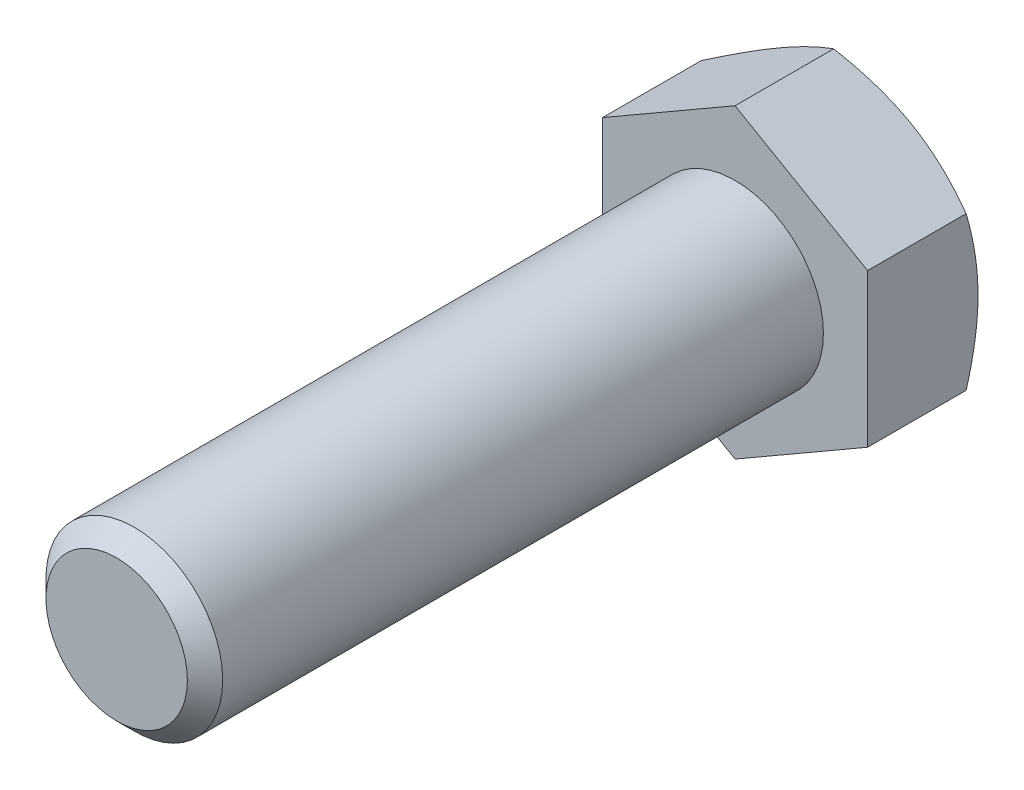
ISO-10303-21;
HEADER;
FILE_DESCRIPTION(('STEP AP214'),'2;1');
FILE_NAME('part.step','',(''),(''),'','','');
FILE_SCHEMA(('AUTOMOTIVE_DESIGN { 1 0 10303 214 1 1 1 1 }'));
ENDSEC;
DATA;
#1=APPLICATION_CONTEXT('core data for automotive mechanical design processes');
#2=APPLICATION_PROTOCOL_DEFINITION('international standard','automotive_design',2000,#1);
#3=PRODUCT_CONTEXT('',#1,'mechanical');
#4=PRODUCT('Part','Part','',(#3));
#5=PRODUCT_RELATED_PRODUCT_CATEGORY('part','',(#4));
#6=PRODUCT_DEFINITION_FORMATION('','',#4);
#7=PRODUCT_DEFINITION_CONTEXT('part definition',#1,'design');
#8=PRODUCT_DEFINITION('design','',#6,#7);
#9=PRODUCT_DEFINITION_SHAPE('','',#8);
#10=(LENGTH_UNIT() NAMED_UNIT(*) SI_UNIT(.MILLI.,.METRE.));
#11=(NAMED_UNIT(*) PLANE_ANGLE_UNIT() SI_UNIT($,.RADIAN.));
#12=(NAMED_UNIT(*) SI_UNIT($,.STERADIAN.) SOLID_ANGLE_UNIT());
#13=UNCERTAINTY_MEASURE_WITH_UNIT(LENGTH_MEASURE(1.E-05),#10,'distance_accuracy_value','');
#14=(GEOMETRIC_REPRESENTATION_CONTEXT(3) GLOBAL_UNCERTAINTY_ASSIGNED_CONTEXT((#13)) GLOBAL_UNIT_ASSIGNED_CONTEXT((#10,
#11,#12)) REPRESENTATION_CONTEXT('',''));
#15=CARTESIAN_POINT('',(0.,0.,0.));
#16=DIRECTION('',(0.,0.,1.));
#17=DIRECTION('',(1.,0.,0.));
#18=AXIS2_PLACEMENT_3D('',#15,#16,#17);
#19=CARTESIAN_POINT('',(0.,0.,70.));
#20=DIRECTION('',(0.,0.,1.));
#21=DIRECTION('',(1.,0.,0.));
#22=AXIS2_PLACEMENT_3D('',#19,#20,#21);
#23=PLANE('',#22);
#24=CARTESIAN_POINT('',(0.,0.,70.));
#25=DIRECTION('',(0.,0.,1.));
#26=DIRECTION('',(1.,0.,0.));
#27=AXIS2_PLACEMENT_3D('',#24,#25,#26);
#28=CIRCLE('',#27,8.);
#29=CARTESIAN_POINT('',(8.00000000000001,0.,70.));
#30=VERTEX_POINT('',#29);
#31=EDGE_CURVE('E203',#30,#30,#28,.T.);
#32=ORIENTED_EDGE('',*,*,#31,.T.);
#33=EDGE_LOOP('',(#32));
#34=FACE_BOUND('',#33,.T.);
#35=ADVANCED_FACE('F29',(#34),#23,.T.);
#36=CARTESIAN_POINT('',(0.,0.,0.));
#37=DIRECTION('',(0.,0.,1.));
#38=DIRECTION('',(1.,0.,0.));
#39=AXIS2_PLACEMENT_3D('',#36,#37,#38);
#40=CYLINDRICAL_SURFACE('',#39,10.);
#41=CARTESIAN_POINT('',(0.,0.,68.));
#42=DIRECTION('',(0.,0.,1.));
#43=DIRECTION('',(1.,0.,0.));
#44=AXIS2_PLACEMENT_3D('',#41,#42,#43);
#45=CIRCLE('',#44,10.);
#46=CARTESIAN_POINT('',(10.,0.,68.));
#47=VERTEX_POINT('',#46);
#48=EDGE_CURVE('E205',#47,#47,#45,.F.);
#49=ORIENTED_EDGE('',*,*,#48,.T.);
#50=EDGE_LOOP('',(#49));
#51=FACE_BOUND('',#50,.T.);
#52=CARTESIAN_POINT('',(0.,0.,0.));
#53=DIRECTION('',(0.,0.,1.));
#54=DIRECTION('',(1.,0.,0.));
#55=AXIS2_PLACEMENT_3D('',#52,#53,#54);
#56=CIRCLE('',#55,10.);
#57=CARTESIAN_POINT('',(10.,0.,0.));
#58=VERTEX_POINT('',#57);
#59=EDGE_CURVE('E206',#58,#58,#56,.F.);
#60=ORIENTED_EDGE('',*,*,#59,.F.);
#61=EDGE_LOOP('',(#60));
#62=FACE_BOUND('',#61,.T.);
#63=ADVANCED_FACE('F194',(#51,#62),#40,.T.);
#64=CARTESIAN_POINT('',(0.,0.,70.));
#65=DIRECTION('',(0.,0.,-1.));
#66=DIRECTION('',(-1.,0.,0.));
#67=AXIS2_PLACEMENT_3D('',#64,#65,#66);
#68=CONICAL_SURFACE('',#67,8.,0.785398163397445);
#69=ORIENTED_EDGE('',*,*,#48,.F.);
#70=EDGE_LOOP('',(#69));
#71=FACE_BOUND('',#70,.T.);
#72=ORIENTED_EDGE('',*,*,#31,.F.);
#73=EDGE_LOOP('',(#72));
#74=FACE_BOUND('',#73,.T.);
#75=ADVANCED_FACE('F199',(#71,#74),#68,.T.);
#76=CARTESIAN_POINT('',(0.,17.3205080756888,-12.5));
#77=DIRECTION('',(0.499999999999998,0.86602540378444,0.));
#78=DIRECTION('',(-0.86602540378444,0.499999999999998,0.));
#79=AXIS2_PLACEMENT_3D('',#76,#77,#78);
#80=PLANE('',#79);
#81=CARTESIAN_POINT('',(-0.000200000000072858,17.3206235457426,-11.160187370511));
#82=CARTESIAN_POINT('',(0.329494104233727,17.130274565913,-11.270078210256));
#83=CARTESIAN_POINT('',(0.660474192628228,16.939183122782,-11.3749824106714));
#84=CARTESIAN_POINT('',(1.32508844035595,16.5554679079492,-11.5734314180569));
#85=CARTESIAN_POINT('',(1.65872343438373,16.3628436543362,-11.6669724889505));
#86=CARTESIAN_POINT('',(2.32929228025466,15.9756905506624,-11.8414378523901));
#87=CARTESIAN_POINT('',(2.66623200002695,15.7811583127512,-11.9223322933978));
#88=CARTESIAN_POINT('',(3.34245276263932,15.3907420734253,-12.0697673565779));
#89=CARTESIAN_POINT('',(3.68173367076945,15.1948581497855,-12.1363087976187));
#90=CARTESIAN_POINT('',(4.35394314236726,14.8067578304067,-12.2522076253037));
#91=CARTESIAN_POINT('',(4.68682180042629,14.6145702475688,-12.3019486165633));
#92=CARTESIAN_POINT('',(5.35410443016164,14.2293144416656,-12.3853532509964));
#93=CARTESIAN_POINT('',(5.68850843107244,14.0362462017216,-12.4190165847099));
#94=CARTESIAN_POINT('',(6.3578781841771,13.6497853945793,-12.4694159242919));
#95=CARTESIAN_POINT('',(6.6928427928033,13.4563934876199,-12.486172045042));
#96=CARTESIAN_POINT('',(7.36308121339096,13.0694311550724,-12.502396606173));
#97=CARTESIAN_POINT('',(7.6983550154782,12.8758607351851,-12.5018655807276));
#98=CARTESIAN_POINT('',(8.32514688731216,12.5139822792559,-12.4847233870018));
#99=CARTESIAN_POINT('',(8.61670962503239,12.3456484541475,-12.470203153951));
#100=CARTESIAN_POINT('',(9.19916443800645,12.0093680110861,-12.4283628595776));
#101=CARTESIAN_POINT('',(9.49005646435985,11.8414214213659,-12.4010418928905));
#102=CARTESIAN_POINT('',(10.0710118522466,11.5060066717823,-12.3340764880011));
#103=CARTESIAN_POINT('',(10.3610743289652,11.338539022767,-12.2944218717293));
#104=CARTESIAN_POINT('',(10.939839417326,11.0043888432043,-12.2034848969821));
#105=CARTESIAN_POINT('',(11.2285419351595,10.8377063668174,-12.1522017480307));
#106=CARTESIAN_POINT('',(12.1049144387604,10.3317324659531,-11.9796131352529));
#107=CARTESIAN_POINT('',(12.6900465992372,9.99390625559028,-11.8410988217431));
#108=CARTESIAN_POINT('',(13.8515859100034,9.32329122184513,-11.5267280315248));
#109=CARTESIAN_POINT('',(14.4280079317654,8.99049381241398,-11.3509453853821));
#110=CARTESIAN_POINT('',(15.0002,8.66013856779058,-11.160187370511));
#111=B_SPLINE_CURVE_WITH_KNOTS('',3,(#81,#82,#83,#84,#85,#86,#87,#88,#89,#90,#91,#92,#93,#94,
#95,#96,#97,#98,#99,#100,#101,#102,#103,#104,#105,#106,#107,#108,#109,#110),.UNSPECIFIED.,.F.,
.F.,(4,2,2,2,2,2,2,2,2,2,2,2,2,2,4),(0.,1.18875411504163,2.37789802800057,3.56980778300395,
4.76164951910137,5.9240737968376,7.08652044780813,8.2475824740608,9.40860862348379,
10.4193068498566,11.4300765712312,12.4416826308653,13.4533574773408,15.5211962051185,
17.5849760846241),.UNSPECIFIED.);
#112=CARTESIAN_POINT('',(0.,17.3205080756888,-11.1602540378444));
#113=VERTEX_POINT('',#112);
#114=CARTESIAN_POINT('',(7.49999999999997,12.9903810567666,-12.5));
#115=VERTEX_POINT('',#114);
#116=EDGE_CURVE('E239',#113,#115,#111,.T.);
#117=ORIENTED_EDGE('',*,*,#116,.F.);
#118=DIRECTION('',(0.,0.,1.));
#119=VECTOR('',#118,1.);
#120=CARTESIAN_POINT('',(0.,17.3205080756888,-12.5));
#121=LINE('',#120,#119);
#122=CARTESIAN_POINT('',(0.,17.3205080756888,0.));
#123=VERTEX_POINT('',#122);
#124=EDGE_CURVE('E213',#113,#123,#121,.T.);
#125=ORIENTED_EDGE('',*,*,#124,.T.);
#126=DIRECTION('',(-0.86602540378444,0.499999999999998,0.));
#127=VECTOR('',#126,1.);
#128=CARTESIAN_POINT('',(0.,17.3205080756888,0.));
#129=LINE('',#128,#127);
#130=CARTESIAN_POINT('',(15.,8.66025403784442,0.));
#131=VERTEX_POINT('',#130);
#132=EDGE_CURVE('E237',#131,#123,#129,.T.);
#133=ORIENTED_EDGE('',*,*,#132,.F.);
#134=DIRECTION('',(0.,0.,1.));
#135=VECTOR('',#134,1.);
#136=CARTESIAN_POINT('',(15.,8.66025403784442,-12.5));
#137=LINE('',#136,#135);
#138=CARTESIAN_POINT('',(15.,8.66025403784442,-11.1602540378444));
#139=VERTEX_POINT('',#138);
#140=EDGE_CURVE('E210',#139,#131,#137,.T.);
#141=ORIENTED_EDGE('',*,*,#140,.F.);
#142=EDGE_CURVE('E169',#115,#139,#111,.T.);
#143=ORIENTED_EDGE('',*,*,#142,.F.);
#144=EDGE_LOOP('',(#117,#125,#133,#141,#143));
#145=FACE_BOUND('',#144,.T.);
#146=ADVANCED_FACE('F179',(#145),#80,.T.);
#147=CARTESIAN_POINT('',(15.,-8.66025403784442,-12.5));
#148=DIRECTION('',(1.,0.,0.));
#149=DIRECTION('',(0.,0.,-1.));
#150=AXIS2_PLACEMENT_3D('',#147,#148,#149);
#151=PLANE('',#150);
#152=CARTESIAN_POINT('',(15.,-23.656342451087,-4.98802951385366));
#153=CARTESIAN_POINT('',(15.,-23.3270368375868,-5.14859323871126));
#154=CARTESIAN_POINT('',(15.,-22.9973552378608,-5.30838548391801));
#155=CARTESIAN_POINT('',(15.,-22.3371617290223,-5.62625300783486));
#156=CARTESIAN_POINT('',(15.,-22.00664981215,-5.7843282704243));
#157=CARTESIAN_POINT('',(15.,-21.0136682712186,-6.25575678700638));
#158=CARTESIAN_POINT('',(15.,-20.3498444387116,-6.56626799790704));
#159=CARTESIAN_POINT('',(15.,-19.0144565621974,-7.1794948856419));
#160=CARTESIAN_POINT('',(15.,-18.3428702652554,-7.48216221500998));
#161=CARTESIAN_POINT('',(15.,-16.9944919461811,-8.07562821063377));
#162=CARTESIAN_POINT('',(15.,-16.3177001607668,-8.36642741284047));
#163=CARTESIAN_POINT('',(15.,-14.9346939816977,-8.9426707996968));
#164=CARTESIAN_POINT('',(15.,-14.2282621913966,-9.22759584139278));
#165=CARTESIAN_POINT('',(15.,-12.8072761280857,-9.77682099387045));
#166=CARTESIAN_POINT('',(15.,-12.0927209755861,-10.0411188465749));
#167=CARTESIAN_POINT('',(15.,-10.6555877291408,-10.5424349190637));
#168=CARTESIAN_POINT('',(15.,-9.93302789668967,-10.7795050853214));
#169=CARTESIAN_POINT('',(15.,-8.47748492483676,-11.2190363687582));
#170=CARTESIAN_POINT('',(15.,-7.74450501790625,-11.4215079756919));
#171=CARTESIAN_POINT('',(15.,-6.63906626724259,-11.691591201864));
#172=CARTESIAN_POINT('',(15.,-6.2706460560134,-11.7758229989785));
#173=CARTESIAN_POINT('',(15.,-5.53121828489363,-11.9321086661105));
#174=CARTESIAN_POINT('',(15.,-5.1602107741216,-12.0041627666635));
#175=CARTESIAN_POINT('',(15.,-4.41583632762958,-12.1348466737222));
#176=CARTESIAN_POINT('',(15.,-4.04246944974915,-12.1934768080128));
#177=CARTESIAN_POINT('',(15.,-3.29373978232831,-12.2961594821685));
#178=CARTESIAN_POINT('',(15.,-2.91837708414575,-12.3402126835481));
#179=CARTESIAN_POINT('',(15.,-2.17125057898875,-12.4122914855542));
#180=CARTESIAN_POINT('',(15.,-1.7995071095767,-12.4405265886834));
#181=CARTESIAN_POINT('',(15.,-1.0551586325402,-12.4812352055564));
#182=CARTESIAN_POINT('',(15.,-0.682553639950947,-12.4937089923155));
#183=CARTESIAN_POINT('',(15.,0.0628536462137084,-12.5025960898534));
#184=CARTESIAN_POINT('',(15.,0.435655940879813,-12.4990093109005));
#185=CARTESIAN_POINT('',(15.,1.18076829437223,-12.4758669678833));
#186=CARTESIAN_POINT('',(15.,1.55307833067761,-12.456310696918));
#187=CARTESIAN_POINT('',(15.,2.43604587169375,-12.3914173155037));
#188=CARTESIAN_POINT('',(15.,2.94620665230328,-12.3391608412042));
#189=CARTESIAN_POINT('',(15.,3.96297341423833,-12.2074265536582));
#190=CARTESIAN_POINT('',(15.,4.46957894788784,-12.1279453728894));
#191=CARTESIAN_POINT('',(15.,5.98333889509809,-11.8528606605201));
#192=CARTESIAN_POINT('',(15.,6.98394325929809,-11.6206572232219));
#193=CARTESIAN_POINT('',(15.,8.48096930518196,-11.2149672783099));
#194=CARTESIAN_POINT('',(15.,8.98506717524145,-11.0681521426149));
#195=CARTESIAN_POINT('',(15.,9.98837333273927,-10.7585239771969));
#196=CARTESIAN_POINT('',(15.,10.4875815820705,-10.5957108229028));
#197=CARTESIAN_POINT('',(15.,11.4812605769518,-10.2567587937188));
#198=CARTESIAN_POINT('',(15.,11.9757325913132,-10.0806236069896));
#199=CARTESIAN_POINT('',(15.,12.7143247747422,-9.80804005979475));
#200=CARTESIAN_POINT('',(15.,12.9600014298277,-9.71578264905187));
#201=CARTESIAN_POINT('',(15.,13.4503781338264,-9.5287050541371));
#202=CARTESIAN_POINT('',(15.,13.6950781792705,-9.43388486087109));
#203=CARTESIAN_POINT('',(15.,14.359390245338,-9.1727978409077));
#204=CARTESIAN_POINT('',(15.,14.7781022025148,-9.0042384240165));
#205=CARTESIAN_POINT('',(15.,15.6130793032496,-8.6611558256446));
#206=CARTESIAN_POINT('',(15.,16.0293443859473,-8.48663249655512));
#207=CARTESIAN_POINT('',(15.,17.2749256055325,-7.95534410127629));
#208=CARTESIAN_POINT('',(15.,18.1009632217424,-7.59088627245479));
#209=CARTESIAN_POINT('',(15.,19.7463472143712,-6.84641952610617));
#210=CARTESIAN_POINT('',(15.,20.5656908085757,-6.46640450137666));
#211=CARTESIAN_POINT('',(15.,22.1987342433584,-5.6945498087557));
#212=CARTESIAN_POINT('',(15.,23.0124343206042,-5.30271064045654));
#213=CARTESIAN_POINT('',(15.,24.6366504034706,-4.50915614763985));
#214=CARTESIAN_POINT('',(15.,25.4471589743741,-4.1074256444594));
#215=CARTESIAN_POINT('',(15.,27.0645048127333,-3.29663533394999));
#216=CARTESIAN_POINT('',(15.,27.8713420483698,-2.88757546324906));
#217=CARTESIAN_POINT('',(15.,29.481823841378,-2.06366878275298));
#218=CARTESIAN_POINT('',(15.,30.2854690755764,-1.64882329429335));
#219=CARTESIAN_POINT('',(15.,31.890265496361,-0.814347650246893));
#220=CARTESIAN_POINT('',(15.,32.691416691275,-0.39471751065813));
#221=CARTESIAN_POINT('',(15.,34.9203498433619,0.77972707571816));
#222=CARTESIAN_POINT('',(15.,36.3458714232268,1.53883048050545));
#223=CARTESIAN_POINT('',(15.,39.1921522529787,3.06610948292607));
#224=CARTESIAN_POINT('',(15.,40.6129111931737,3.83428565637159));
#225=CARTESIAN_POINT('',(15.,43.445900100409,5.37475686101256));
#226=CARTESIAN_POINT('',(15.,44.8581426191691,6.14702882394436));
#227=CARTESIAN_POINT('',(15.,46.9743278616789,7.30926449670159));
#228=CARTESIAN_POINT('',(15.,47.6793316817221,7.6972987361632));
#229=CARTESIAN_POINT('',(15.,49.08870787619,8.47451029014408));
#230=CARTESIAN_POINT('',(15.,49.7930802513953,8.8636876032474));
#231=CARTESIAN_POINT('',(15.,50.4971756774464,9.2533654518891));
#232=B_SPLINE_CURVE_WITH_KNOTS('',3,(#152,#153,#154,#155,#156,#157,#158,#159,#160,#161,#162,
#163,#164,#165,#166,#167,#168,#169,#170,#171,#172,#173,#174,#175,#176,#177,#178,#179,#180,#181,
#182,#183,#184,#185,#186,#187,#188,#189,#190,#191,#192,#193,#194,#195,#196,#197,#198,#199,#200,
#201,#202,#203,#204,#205,#206,#207,#208,#209,#210,#211,#212,#213,#214,#215,#216,#217,#218,#219,
#220,#221,#222,#223,#224,#225,#226,#227,#228,#229,#230,#231),.UNSPECIFIED.,.F.,.F.,(4,2,2,2,2,2,
2,2,2,2,2,2,2,2,2,2,2,2,2,2,2,2,2,2,2,2,2,2,2,2,2,2,2,2,2,2,2,2,2,4),(0.,1.09909142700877,
2.19819316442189,4.39670244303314,6.60652703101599,8.81625171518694,11.1011868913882,
13.3863718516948,15.667121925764,17.9471792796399,19.0807901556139,20.2143795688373,
21.3479412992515,22.4814515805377,23.5995709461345,24.7176709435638,25.8357771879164,
26.9539329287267,28.4915630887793,30.0293835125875,33.1065029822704,34.6814865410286,
36.2564823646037,37.8310437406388,38.618315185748,39.4055894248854,40.7596309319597,
42.1137059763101,44.8220642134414,47.5314960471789,50.2408135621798,52.9545856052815,
55.668381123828,58.3815666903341,61.0947431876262,65.939807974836,70.7851819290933,
75.6139863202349,78.0281952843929,80.4424012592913),.UNSPECIFIED.);
#233=CARTESIAN_POINT('',(15.,0.,-12.5));
#234=VERTEX_POINT('',#233);
#235=EDGE_CURVE('E167',#139,#234,#232,.F.);
#236=ORIENTED_EDGE('',*,*,#235,.F.);
#237=ORIENTED_EDGE('',*,*,#140,.T.);
#238=DIRECTION('',(0.,1.,0.));
#239=VECTOR('',#238,1.);
#240=CARTESIAN_POINT('',(15.,-8.66025403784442,0.));
#241=LINE('',#240,#239);
#242=CARTESIAN_POINT('',(15.,-8.66025403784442,0.));
#243=VERTEX_POINT('',#242);
#244=EDGE_CURVE('E215',#243,#131,#241,.T.);
#245=ORIENTED_EDGE('',*,*,#244,.F.);
#246=DIRECTION('',(0.,0.,1.));
#247=VECTOR('',#246,1.);
#248=CARTESIAN_POINT('',(15.,-8.66025403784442,-12.5));
#249=LINE('',#248,#247);
#250=CARTESIAN_POINT('',(15.,-8.66025403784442,-11.1602540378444));
#251=VERTEX_POINT('',#250);
#252=EDGE_CURVE('E221',#251,#243,#249,.T.);
#253=ORIENTED_EDGE('',*,*,#252,.F.);
#254=EDGE_CURVE('E162',#234,#251,#232,.F.);
#255=ORIENTED_EDGE('',*,*,#254,.F.);
#256=EDGE_LOOP('',(#236,#237,#245,#253,#255));
#257=FACE_BOUND('',#256,.T.);
#258=ADVANCED_FACE('F175',(#257),#151,.T.);
#259=CARTESIAN_POINT('',(0.,-17.3205080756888,-12.5));
#260=DIRECTION('',(0.499999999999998,-0.86602540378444,0.));
#261=DIRECTION('',(0.86602540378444,0.499999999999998,0.));
#262=AXIS2_PLACEMENT_3D('',#259,#260,#261);
#263=PLANE('',#262);
#264=CARTESIAN_POINT('',(15.0002,-8.66013856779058,-11.160187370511));
#265=CARTESIAN_POINT('',(14.6705058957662,-8.85048754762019,-11.2700782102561));
#266=CARTESIAN_POINT('',(14.3395258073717,-9.04157899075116,-11.3749824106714));
#267=CARTESIAN_POINT('',(13.674911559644,-9.42529420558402,-11.5734314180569));
#268=CARTESIAN_POINT('',(13.3412765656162,-9.61791845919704,-11.6669724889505));
#269=CARTESIAN_POINT('',(12.6707077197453,-10.0050715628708,-11.8414378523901));
#270=CARTESIAN_POINT('',(12.333767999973,-10.199603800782,-11.9223322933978));
#271=CARTESIAN_POINT('',(11.6575472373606,-10.5900200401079,-12.069767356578));
#272=CARTESIAN_POINT('',(11.3182663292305,-10.7859039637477,-12.1363087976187));
#273=CARTESIAN_POINT('',(10.6460568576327,-11.1740042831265,-12.2522076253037));
#274=CARTESIAN_POINT('',(10.3131781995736,-11.3661918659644,-12.3019486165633));
#275=CARTESIAN_POINT('',(9.64589556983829,-11.7514476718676,-12.3853532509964));
#276=CARTESIAN_POINT('',(9.31149156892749,-11.9445159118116,-12.4190165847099));
#277=CARTESIAN_POINT('',(8.64212181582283,-12.3309767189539,-12.4694159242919));
#278=CARTESIAN_POINT('',(8.30715720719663,-12.5243686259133,-12.486172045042));
#279=CARTESIAN_POINT('',(7.63691878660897,-12.9113309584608,-12.502396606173));
#280=CARTESIAN_POINT('',(7.30164498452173,-13.1049013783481,-12.5018655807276));
#281=CARTESIAN_POINT('',(6.67485311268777,-13.4667798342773,-12.4847233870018));
#282=CARTESIAN_POINT('',(6.38329037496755,-13.6351136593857,-12.470203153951));
#283=CARTESIAN_POINT('',(5.80083556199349,-13.9713941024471,-12.4283628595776));
#284=CARTESIAN_POINT('',(5.50994353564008,-14.1393406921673,-12.4010418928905));
#285=CARTESIAN_POINT('',(4.92898814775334,-14.4747554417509,-12.3340764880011));
#286=CARTESIAN_POINT('',(4.63892567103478,-14.6422230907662,-12.2944218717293));
#287=CARTESIAN_POINT('',(4.06016058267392,-14.9763732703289,-12.2034848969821));
#288=CARTESIAN_POINT('',(3.77145806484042,-15.1430557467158,-12.1522017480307));
#289=CARTESIAN_POINT('',(2.89508556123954,-15.6490296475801,-11.9796131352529));
#290=CARTESIAN_POINT('',(2.30995340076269,-15.9868558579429,-11.8410988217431));
#291=CARTESIAN_POINT('',(1.14841408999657,-16.6574708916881,-11.5267280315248));
#292=CARTESIAN_POINT('',(0.571992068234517,-16.9902683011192,-11.3509453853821));
#293=CARTESIAN_POINT('',(-0.000200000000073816,-17.3206235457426,-11.160187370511));
#294=B_SPLINE_CURVE_WITH_KNOTS('',3,(#264,#265,#266,#267,#268,#269,#270,#271,#272,#273,#274,
#275,#276,#277,#278,#279,#280,#281,#282,#283,#284,#285,#286,#287,#288,#289,#290,#291,#292,#293),
.UNSPECIFIED.,.F.,.F.,(4,2,2,2,2,2,2,2,2,2,2,2,2,2,4),(0.,1.18875411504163,2.37789802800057,
3.56980778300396,4.76164951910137,5.9240737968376,7.08652044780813,8.2475824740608,
9.40860862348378,10.4193068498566,11.4300765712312,12.4416826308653,13.4533574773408,
15.5211962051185,17.5849760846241),.UNSPECIFIED.);
#295=CARTESIAN_POINT('',(7.49999999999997,-12.9903810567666,-12.5));
#296=VERTEX_POINT('',#295);
#297=EDGE_CURVE('E168',#251,#296,#294,.T.);
#298=ORIENTED_EDGE('',*,*,#297,.F.);
#299=ORIENTED_EDGE('',*,*,#252,.T.);
#300=DIRECTION('',(0.86602540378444,0.499999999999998,0.));
#301=VECTOR('',#300,1.);
#302=CARTESIAN_POINT('',(0.,-17.3205080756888,0.));
#303=LINE('',#302,#301);
#304=CARTESIAN_POINT('',(0.,-17.3205080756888,0.));
#305=VERTEX_POINT('',#304);
#306=EDGE_CURVE('E226',#305,#243,#303,.T.);
#307=ORIENTED_EDGE('',*,*,#306,.F.);
#308=DIRECTION('',(0.,0.,1.));
#309=VECTOR('',#308,1.);
#310=CARTESIAN_POINT('',(0.,-17.3205080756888,-12.5));
#311=LINE('',#310,#309);
#312=CARTESIAN_POINT('',(0.,-17.3205080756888,-11.1602540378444));
#313=VERTEX_POINT('',#312);
#314=EDGE_CURVE('E219',#313,#305,#311,.T.);
#315=ORIENTED_EDGE('',*,*,#314,.F.);
#316=EDGE_CURVE('E156',#296,#313,#294,.T.);
#317=ORIENTED_EDGE('',*,*,#316,.F.);
#318=EDGE_LOOP('',(#298,#299,#307,#315,#317));
#319=FACE_BOUND('',#318,.T.);
#320=ADVANCED_FACE('F178',(#319),#263,.T.);
#321=CARTESIAN_POINT('',(0.,-17.3205080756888,-12.5));
#322=DIRECTION('',(-0.500000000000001,-0.866025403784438,0.));
#323=DIRECTION('',(0.866025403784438,-0.500000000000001,0.));
#324=AXIS2_PLACEMENT_3D('',#321,#322,#323);
#325=PLANE('',#324);
#326=CARTESIAN_POINT('',(0.000199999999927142,-17.3206235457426,-11.160187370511));
#327=CARTESIAN_POINT('',(-0.329494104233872,-17.130274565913,-11.270078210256));
#328=CARTESIAN_POINT('',(-0.660474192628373,-16.939183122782,-11.3749824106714));
#329=CARTESIAN_POINT('',(-1.32508844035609,-16.5554679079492,-11.5734314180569));
#330=CARTESIAN_POINT('',(-1.65872343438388,-16.3628436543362,-11.6669724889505));
#331=CARTESIAN_POINT('',(-2.32929228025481,-15.9756905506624,-11.8414378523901));
#332=CARTESIAN_POINT('',(-2.66623200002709,-15.7811583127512,-11.9223322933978));
#333=CARTESIAN_POINT('',(-3.34245276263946,-15.3907420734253,-12.0697673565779));
#334=CARTESIAN_POINT('',(-3.68173367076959,-15.1948581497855,-12.1363087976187));
#335=CARTESIAN_POINT('',(-4.3539431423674,-14.8067578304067,-12.2522076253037));
#336=CARTESIAN_POINT('',(-4.68682180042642,-14.6145702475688,-12.3019486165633));
#337=CARTESIAN_POINT('',(-5.35410443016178,-14.2293144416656,-12.3853532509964));
#338=CARTESIAN_POINT('',(-5.68850843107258,-14.0362462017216,-12.4190165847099));
#339=CARTESIAN_POINT('',(-6.35787818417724,-13.6497853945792,-12.4694159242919));
#340=CARTESIAN_POINT('',(-6.69284279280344,-13.4563934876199,-12.4861720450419));
#341=CARTESIAN_POINT('',(-7.36308121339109,-13.0694311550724,-12.502396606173));
#342=CARTESIAN_POINT('',(-7.69835501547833,-12.8758607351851,-12.5018655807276));
#343=CARTESIAN_POINT('',(-8.32514688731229,-12.5139822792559,-12.4847233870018));
#344=CARTESIAN_POINT('',(-8.61670962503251,-12.3456484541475,-12.470203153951));
#345=CARTESIAN_POINT('',(-9.19916443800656,-12.0093680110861,-12.4283628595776));
#346=CARTESIAN_POINT('',(-9.49005646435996,-11.8414214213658,-12.4010418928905));
#347=CARTESIAN_POINT('',(-10.0710118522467,-11.5060066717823,-12.3340764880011));
#348=CARTESIAN_POINT('',(-10.3610743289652,-11.338539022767,-12.2944218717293));
#349=CARTESIAN_POINT('',(-10.9398394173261,-11.0043888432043,-12.2034848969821));
#350=CARTESIAN_POINT('',(-11.2285419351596,-10.8377063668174,-12.1522017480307));
#351=CARTESIAN_POINT('',(-12.1049144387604,-10.3317324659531,-11.9796131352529));
#352=CARTESIAN_POINT('',(-12.6900465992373,-9.99390625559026,-11.841098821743));
#353=CARTESIAN_POINT('',(-13.8515859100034,-9.32329122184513,-11.5267280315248));
#354=CARTESIAN_POINT('',(-14.4280079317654,-8.99049381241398,-11.3509453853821));
#355=CARTESIAN_POINT('',(-15.0002,-8.66013856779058,-11.160187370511));
#356=B_SPLINE_CURVE_WITH_KNOTS('',3,(#326,#327,#328,#329,#330,#331,#332,#333,#334,#335,#336,
#337,#338,#339,#340,#341,#342,#343,#344,#345,#346,#347,#348,#349,#350,#351,#352,#353,#354,#355),
.UNSPECIFIED.,.F.,.F.,(4,2,2,2,2,2,2,2,2,2,2,2,2,2,4),(0.,1.18875411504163,2.37789802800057,
3.56980778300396,4.76164951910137,5.9240737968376,7.08652044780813,8.2475824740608,
9.40860862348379,10.4193068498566,11.4300765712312,12.4416826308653,13.4533574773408,
15.5211962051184,17.584976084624),.UNSPECIFIED.);
#357=CARTESIAN_POINT('',(-7.50000000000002,-12.9903810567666,-12.5));
#358=VERTEX_POINT('',#357);
#359=EDGE_CURVE('E258',#313,#358,#356,.T.);
#360=ORIENTED_EDGE('',*,*,#359,.F.);
#361=ORIENTED_EDGE('',*,*,#314,.T.);
#362=DIRECTION('',(0.866025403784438,-0.500000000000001,0.));
#363=VECTOR('',#362,1.);
#364=CARTESIAN_POINT('',(0.,-17.3205080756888,0.));
#365=LINE('',#364,#363);
#366=CARTESIAN_POINT('',(-15.,-8.66025403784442,0.));
#367=VERTEX_POINT('',#366);
#368=EDGE_CURVE('E229',#367,#305,#365,.T.);
#369=ORIENTED_EDGE('',*,*,#368,.F.);
#370=DIRECTION('',(0.,0.,1.));
#371=VECTOR('',#370,1.);
#372=CARTESIAN_POINT('',(-15.,-8.66025403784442,-12.5));
#373=LINE('',#372,#371);
#374=CARTESIAN_POINT('',(-15.,-8.66025403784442,-11.1602540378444));
#375=VERTEX_POINT('',#374);
#376=EDGE_CURVE('E217',#375,#367,#373,.T.);
#377=ORIENTED_EDGE('',*,*,#376,.F.);
#378=EDGE_CURVE('E105',#358,#375,#356,.T.);
#379=ORIENTED_EDGE('',*,*,#378,.F.);
#380=EDGE_LOOP('',(#360,#361,#369,#377,#379));
#381=FACE_BOUND('',#380,.T.);
#382=ADVANCED_FACE('F183',(#381),#325,.T.);
#383=CARTESIAN_POINT('',(-15.,-8.66025403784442,-12.5));
#384=DIRECTION('',(-1.,0.,0.));
#385=DIRECTION('',(0.,0.,1.));
#386=AXIS2_PLACEMENT_3D('',#383,#384,#385);
#387=PLANE('',#386);
#388=CARTESIAN_POINT('',(-15.,-23.656342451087,-4.98802951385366));
#389=CARTESIAN_POINT('',(-15.,-23.3270368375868,-5.14859323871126));
#390=CARTESIAN_POINT('',(-15.,-22.9973552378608,-5.30838548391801));
#391=CARTESIAN_POINT('',(-15.,-22.3371617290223,-5.62625300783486));
#392=CARTESIAN_POINT('',(-15.,-22.00664981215,-5.7843282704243));
#393=CARTESIAN_POINT('',(-15.,-21.0136682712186,-6.25575678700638));
#394=CARTESIAN_POINT('',(-15.,-20.3498444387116,-6.56626799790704));
#395=CARTESIAN_POINT('',(-15.,-19.0144565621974,-7.1794948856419));
#396=CARTESIAN_POINT('',(-15.,-18.3428702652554,-7.48216221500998));
#397=CARTESIAN_POINT('',(-15.,-16.9944919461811,-8.07562821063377));
#398=CARTESIAN_POINT('',(-15.,-16.3177001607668,-8.36642741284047));
#399=CARTESIAN_POINT('',(-15.,-14.9346939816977,-8.9426707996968));
#400=CARTESIAN_POINT('',(-15.,-14.2282621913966,-9.22759584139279));
#401=CARTESIAN_POINT('',(-15.,-12.8072761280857,-9.77682099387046));
#402=CARTESIAN_POINT('',(-15.,-12.0927209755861,-10.0411188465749));
#403=CARTESIAN_POINT('',(-15.,-10.6555877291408,-10.5424349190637));
#404=CARTESIAN_POINT('',(-15.,-9.93302789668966,-10.7795050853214));
#405=CARTESIAN_POINT('',(-15.,-8.47748492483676,-11.2190363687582));
#406=CARTESIAN_POINT('',(-15.,-7.74450501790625,-11.4215079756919));
#407=CARTESIAN_POINT('',(-15.,-6.63906626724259,-11.691591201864));
#408=CARTESIAN_POINT('',(-15.,-6.2706460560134,-11.7758229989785));
#409=CARTESIAN_POINT('',(-15.,-5.53121828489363,-11.9321086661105));
#410=CARTESIAN_POINT('',(-15.,-5.1602107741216,-12.0041627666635));
#411=CARTESIAN_POINT('',(-15.,-4.41583632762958,-12.1348466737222));
#412=CARTESIAN_POINT('',(-15.,-4.04246944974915,-12.1934768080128));
#413=CARTESIAN_POINT('',(-15.,-3.29373978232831,-12.2961594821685));
#414=CARTESIAN_POINT('',(-15.,-2.91837708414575,-12.3402126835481));
#415=CARTESIAN_POINT('',(-15.,-2.17125057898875,-12.4122914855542));
#416=CARTESIAN_POINT('',(-15.,-1.7995071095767,-12.4405265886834));
#417=CARTESIAN_POINT('',(-15.,-1.05515863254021,-12.4812352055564));
#418=CARTESIAN_POINT('',(-15.,-0.68255363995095,-12.4937089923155));
#419=CARTESIAN_POINT('',(-15.,0.0628536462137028,-12.5025960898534));
#420=CARTESIAN_POINT('',(-15.,0.435655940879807,-12.4990093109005));
#421=CARTESIAN_POINT('',(-15.,1.18076829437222,-12.4758669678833));
#422=CARTESIAN_POINT('',(-15.,1.5530783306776,-12.456310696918));
#423=CARTESIAN_POINT('',(-15.,2.43604587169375,-12.3914173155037));
#424=CARTESIAN_POINT('',(-15.,2.94620665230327,-12.3391608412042));
#425=CARTESIAN_POINT('',(-15.,3.96297341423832,-12.2074265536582));
#426=CARTESIAN_POINT('',(-15.,4.46957894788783,-12.1279453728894));
#427=CARTESIAN_POINT('',(-15.,5.98333889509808,-11.8528606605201));
#428=CARTESIAN_POINT('',(-15.,6.98394325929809,-11.6206572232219));
#429=CARTESIAN_POINT('',(-15.,8.48096930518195,-11.2149672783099));
#430=CARTESIAN_POINT('',(-15.,8.98506717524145,-11.0681521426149));
#431=CARTESIAN_POINT('',(-15.,9.98837333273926,-10.7585239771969));
#432=CARTESIAN_POINT('',(-15.,10.4875815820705,-10.5957108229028));
#433=CARTESIAN_POINT('',(-15.,11.4812605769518,-10.2567587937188));
#434=CARTESIAN_POINT('',(-15.,11.9757325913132,-10.0806236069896));
#435=CARTESIAN_POINT('',(-15.,12.7143247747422,-9.80804005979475));
#436=CARTESIAN_POINT('',(-15.,12.9600014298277,-9.71578264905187));
#437=CARTESIAN_POINT('',(-15.,13.4503781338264,-9.5287050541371));
#438=CARTESIAN_POINT('',(-15.,13.6950781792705,-9.4338848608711));
#439=CARTESIAN_POINT('',(-15.,14.359390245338,-9.1727978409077));
#440=CARTESIAN_POINT('',(-15.,14.7781022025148,-9.00423842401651));
#441=CARTESIAN_POINT('',(-15.,15.6130793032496,-8.6611558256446));
#442=CARTESIAN_POINT('',(-15.,16.0293443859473,-8.48663249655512));
#443=CARTESIAN_POINT('',(-15.,17.2749256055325,-7.95534410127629));
#444=CARTESIAN_POINT('',(-15.,18.1009632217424,-7.59088627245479));
#445=CARTESIAN_POINT('',(-15.,19.7463472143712,-6.84641952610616));
#446=CARTESIAN_POINT('',(-15.,20.5656908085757,-6.46640450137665));
#447=CARTESIAN_POINT('',(-15.,22.1987342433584,-5.69454980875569));
#448=CARTESIAN_POINT('',(-15.,23.0124343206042,-5.30271064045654));
#449=CARTESIAN_POINT('',(-15.,24.6366504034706,-4.50915614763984));
#450=CARTESIAN_POINT('',(-15.,25.4471589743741,-4.10742564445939));
#451=CARTESIAN_POINT('',(-15.,27.0645048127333,-3.29663533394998));
#452=CARTESIAN_POINT('',(-15.,27.8713420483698,-2.88757546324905));
#453=CARTESIAN_POINT('',(-15.,29.4818238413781,-2.06366878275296));
#454=CARTESIAN_POINT('',(-15.,30.2854690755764,-1.64882329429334));
#455=CARTESIAN_POINT('',(-15.,31.890265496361,-0.814347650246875));
#456=CARTESIAN_POINT('',(-15.,32.691416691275,-0.394717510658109));
#457=CARTESIAN_POINT('',(-15.,34.920349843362,0.779727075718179));
#458=CARTESIAN_POINT('',(-15.,36.3458714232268,1.53883048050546));
#459=CARTESIAN_POINT('',(-15.,39.1921522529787,3.06610948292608));
#460=CARTESIAN_POINT('',(-15.,40.6129111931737,3.8342856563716));
#461=CARTESIAN_POINT('',(-15.,43.4459001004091,5.37475686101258));
#462=CARTESIAN_POINT('',(-15.,44.8581426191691,6.14702882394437));
#463=CARTESIAN_POINT('',(-15.,46.9743278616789,7.3092644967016));
#464=CARTESIAN_POINT('',(-15.,47.6793316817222,7.69729873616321));
#465=CARTESIAN_POINT('',(-15.,49.08870787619,8.47451029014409));
#466=CARTESIAN_POINT('',(-15.,49.7930802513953,8.86368760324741));
#467=CARTESIAN_POINT('',(-15.,50.4971756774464,9.25336545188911));
#468=B_SPLINE_CURVE_WITH_KNOTS('',3,(#388,#389,#390,#391,#392,#393,#394,#395,#396,#397,#398,
#399,#400,#401,#402,#403,#404,#405,#406,#407,#408,#409,#410,#411,#412,#413,#414,#415,#416,#417,
#418,#419,#420,#421,#422,#423,#424,#425,#426,#427,#428,#429,#430,#431,#432,#433,#434,#435,#436,
#437,#438,#439,#440,#441,#442,#443,#444,#445,#446,#447,#448,#449,#450,#451,#452,#453,#454,#455,
#456,#457,#458,#459,#460,#461,#462,#463,#464,#465,#466,#467),.UNSPECIFIED.,.F.,.F.,(4,2,2,2,2,2,
2,2,2,2,2,2,2,2,2,2,2,2,2,2,2,2,2,2,2,2,2,2,2,2,2,2,2,2,2,2,2,2,2,4),(0.,1.09909142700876,
2.19819316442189,4.39670244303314,6.606527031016,8.81625171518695,11.1011868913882,
13.3863718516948,15.667121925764,17.9471792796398,19.0807901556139,20.2143795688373,
21.3479412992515,22.4814515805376,23.5995709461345,24.7176709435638,25.8357771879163,
26.9539329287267,28.4915630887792,30.0293835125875,33.1065029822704,34.6814865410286,
36.2564823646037,37.8310437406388,38.6183151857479,39.4055894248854,40.7596309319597,
42.1137059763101,44.8220642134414,47.5314960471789,50.2408135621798,52.9545856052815,
55.6683811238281,58.3815666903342,61.0947431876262,65.939807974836,70.7851819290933,
75.6139863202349,78.0281952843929,80.4424012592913),.UNSPECIFIED.);
#469=CARTESIAN_POINT('',(-15.,0.,-12.5));
#470=VERTEX_POINT('',#469);
#471=EDGE_CURVE('E100',#375,#470,#468,.T.);
#472=ORIENTED_EDGE('',*,*,#471,.F.);
#473=ORIENTED_EDGE('',*,*,#376,.T.);
#474=DIRECTION('',(0.,-1.,0.));
#475=VECTOR('',#474,1.);
#476=CARTESIAN_POINT('',(-15.,-8.66025403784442,0.));
#477=LINE('',#476,#475);
#478=CARTESIAN_POINT('',(-15.,8.66025403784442,0.));
#479=VERTEX_POINT('',#478);
#480=EDGE_CURVE('E232',#479,#367,#477,.T.);
#481=ORIENTED_EDGE('',*,*,#480,.F.);
#482=DIRECTION('',(0.,0.,1.));
#483=VECTOR('',#482,1.);
#484=CARTESIAN_POINT('',(-15.,8.66025403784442,-12.5));
#485=LINE('',#484,#483);
#486=CARTESIAN_POINT('',(-15.,8.66025403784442,-11.1602540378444));
#487=VERTEX_POINT('',#486);
#488=EDGE_CURVE('E126',#487,#479,#485,.T.);
#489=ORIENTED_EDGE('',*,*,#488,.F.);
#490=EDGE_CURVE('E109',#470,#487,#468,.T.);
#491=ORIENTED_EDGE('',*,*,#490,.F.);
#492=EDGE_LOOP('',(#472,#473,#481,#489,#491));
#493=FACE_BOUND('',#492,.T.);
#494=ADVANCED_FACE('F124',(#493),#387,.T.);
#495=CARTESIAN_POINT('',(-15.,8.66025403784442,-12.5));
#496=DIRECTION('',(-0.500000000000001,0.866025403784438,0.));
#497=DIRECTION('',(-0.866025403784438,-0.500000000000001,0.));
#498=AXIS2_PLACEMENT_3D('',#495,#496,#497);
#499=PLANE('',#498);
#500=CARTESIAN_POINT('',(-15.0002,8.66013856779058,-11.160187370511));
#501=CARTESIAN_POINT('',(-14.6705058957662,8.85048754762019,-11.2700782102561));
#502=CARTESIAN_POINT('',(-14.3395258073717,9.04157899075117,-11.3749824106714));
#503=CARTESIAN_POINT('',(-13.674911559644,9.42529420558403,-11.5734314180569));
#504=CARTESIAN_POINT('',(-13.3412765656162,9.61791845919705,-11.6669724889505));
#505=CARTESIAN_POINT('',(-12.6707077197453,10.0050715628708,-11.8414378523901));
#506=CARTESIAN_POINT('',(-12.333767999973,10.199603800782,-11.9223322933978));
#507=CARTESIAN_POINT('',(-11.6575472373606,10.5900200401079,-12.0697673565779));
#508=CARTESIAN_POINT('',(-11.3182663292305,10.7859039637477,-12.1363087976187));
#509=CARTESIAN_POINT('',(-10.6460568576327,11.1740042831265,-12.2522076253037));
#510=CARTESIAN_POINT('',(-10.3131781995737,11.3661918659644,-12.3019486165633));
#511=CARTESIAN_POINT('',(-9.6458955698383,11.7514476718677,-12.3853532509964));
#512=CARTESIAN_POINT('',(-9.3114915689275,11.9445159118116,-12.4190165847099));
#513=CARTESIAN_POINT('',(-8.64212181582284,12.330976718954,-12.4694159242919));
#514=CARTESIAN_POINT('',(-8.30715720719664,12.5243686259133,-12.4861720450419));
#515=CARTESIAN_POINT('',(-7.63691878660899,12.9113309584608,-12.502396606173));
#516=CARTESIAN_POINT('',(-7.30164498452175,13.1049013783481,-12.5018655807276));
#517=CARTESIAN_POINT('',(-6.67485311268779,13.4667798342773,-12.4847233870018));
#518=CARTESIAN_POINT('',(-6.38329037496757,13.6351136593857,-12.470203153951));
#519=CARTESIAN_POINT('',(-5.80083556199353,13.9713941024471,-12.4283628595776));
#520=CARTESIAN_POINT('',(-5.50994353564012,14.1393406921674,-12.4010418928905));
#521=CARTESIAN_POINT('',(-4.92898814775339,14.4747554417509,-12.3340764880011));
#522=CARTESIAN_POINT('',(-4.63892567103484,14.6422230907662,-12.2944218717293));
#523=CARTESIAN_POINT('',(-4.06016058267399,14.9763732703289,-12.2034848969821));
#524=CARTESIAN_POINT('',(-3.7714580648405,15.1430557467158,-12.1522017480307));
#525=CARTESIAN_POINT('',(-2.89508556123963,15.6490296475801,-11.9796131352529));
#526=CARTESIAN_POINT('',(-2.30995340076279,15.9868558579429,-11.841098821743));
#527=CARTESIAN_POINT('',(-1.1484140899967,16.6574708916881,-11.5267280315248));
#528=CARTESIAN_POINT('',(-0.571992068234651,16.9902683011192,-11.3509453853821));
#529=CARTESIAN_POINT('',(0.000199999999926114,17.3206235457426,-11.160187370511));
#530=B_SPLINE_CURVE_WITH_KNOTS('',3,(#500,#501,#502,#503,#504,#505,#506,#507,#508,#509,#510,
#511,#512,#513,#514,#515,#516,#517,#518,#519,#520,#521,#522,#523,#524,#525,#526,#527,#528,#529),
.UNSPECIFIED.,.F.,.F.,(4,2,2,2,2,2,2,2,2,2,2,2,2,2,4),(0.,1.18875411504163,2.37789802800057,
3.56980778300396,4.76164951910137,5.9240737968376,7.08652044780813,8.2475824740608,
9.40860862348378,10.4193068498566,11.4300765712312,12.4416826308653,13.4533574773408,
15.5211962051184,17.584976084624),.UNSPECIFIED.);
#531=CARTESIAN_POINT('',(-7.50000000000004,12.9903810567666,-12.5));
#532=VERTEX_POINT('',#531);
#533=EDGE_CURVE('E115',#487,#532,#530,.T.);
#534=ORIENTED_EDGE('',*,*,#533,.F.);
#535=ORIENTED_EDGE('',*,*,#488,.T.);
#536=DIRECTION('',(-0.866025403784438,-0.500000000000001,0.));
#537=VECTOR('',#536,1.);
#538=CARTESIAN_POINT('',(-15.,8.66025403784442,0.));
#539=LINE('',#538,#537);
#540=EDGE_CURVE('E235',#123,#479,#539,.T.);
#541=ORIENTED_EDGE('',*,*,#540,.F.);
#542=ORIENTED_EDGE('',*,*,#124,.F.);
#543=EDGE_CURVE('E117',#532,#113,#530,.T.);
#544=ORIENTED_EDGE('',*,*,#543,.F.);
#545=EDGE_LOOP('',(#534,#535,#541,#542,#544));
#546=FACE_BOUND('',#545,.T.);
#547=ADVANCED_FACE('F191',(#546),#499,.T.);
#548=CARTESIAN_POINT('',(15.,8.66025403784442,0.));
#549=DIRECTION('',(0.,0.,1.));
#550=DIRECTION('',(1.,0.,0.));
#551=AXIS2_PLACEMENT_3D('',#548,#549,#550);
#552=PLANE('',#551);
#553=ORIENTED_EDGE('',*,*,#59,.T.);
#554=EDGE_LOOP('',(#553));
#555=FACE_BOUND('',#554,.T.);
#556=ORIENTED_EDGE('',*,*,#132,.T.);
#557=ORIENTED_EDGE('',*,*,#540,.T.);
#558=ORIENTED_EDGE('',*,*,#480,.T.);
#559=ORIENTED_EDGE('',*,*,#368,.T.);
#560=ORIENTED_EDGE('',*,*,#306,.T.);
#561=ORIENTED_EDGE('',*,*,#244,.T.);
#562=EDGE_LOOP('',(#556,#557,#558,#559,#560,#561));
#563=FACE_BOUND('',#562,.T.);
#564=ADVANCED_FACE('F148',(#555,#563),#552,.T.);
#565=CARTESIAN_POINT('',(0.,0.,0.));
#566=DIRECTION('',(0.,0.,1.));
#567=DIRECTION('',(1.,0.,0.));
#568=AXIS2_PLACEMENT_3D('',#565,#566,#567);
#569=CONICAL_SURFACE('',#568,36.6506350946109,1.0471975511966);
#570=ORIENTED_EDGE('',*,*,#142,.T.);
#571=ORIENTED_EDGE('',*,*,#235,.T.);
#572=CARTESIAN_POINT('',(0.,0.,-12.5));
#573=DIRECTION('',(0.,0.,1.));
#574=DIRECTION('',(1.,0.,0.));
#575=AXIS2_PLACEMENT_3D('',#572,#573,#574);
#576=CIRCLE('',#575,15.);
#577=EDGE_CURVE('E32',#115,#234,#576,.F.);
#578=ORIENTED_EDGE('',*,*,#577,.F.);
#579=EDGE_LOOP('',(#570,#571,#578));
#580=FACE_BOUND('',#579,.T.);
#581=ADVANCED_FACE('F248',(#580),#569,.T.);
#582=ORIENTED_EDGE('',*,*,#116,.T.);
#583=EDGE_CURVE('E122',#532,#115,#576,.F.);
#584=ORIENTED_EDGE('',*,*,#583,.F.);
#585=ORIENTED_EDGE('',*,*,#543,.T.);
#586=EDGE_LOOP('',(#582,#584,#585));
#587=FACE_BOUND('',#586,.T.);
#588=ADVANCED_FACE('F147',(#587),#569,.T.);
#589=ORIENTED_EDGE('',*,*,#490,.T.);
#590=ORIENTED_EDGE('',*,*,#533,.T.);
#591=CARTESIAN_POINT('',(0.,0.,-12.5));
#592=DIRECTION('',(0.,0.,-1.));
#593=DIRECTION('',(-1.,0.,0.));
#594=AXIS2_PLACEMENT_3D('',#591,#592,#593);
#595=CIRCLE('',#594,15.);
#596=EDGE_CURVE('E50',#470,#532,#595,.T.);
#597=ORIENTED_EDGE('',*,*,#596,.F.);
#598=EDGE_LOOP('',(#589,#590,#597));
#599=FACE_BOUND('',#598,.T.);
#600=ADVANCED_FACE('F113',(#599),#569,.T.);
#601=ORIENTED_EDGE('',*,*,#378,.T.);
#602=ORIENTED_EDGE('',*,*,#471,.T.);
#603=EDGE_CURVE('E102',#358,#470,#576,.F.);
#604=ORIENTED_EDGE('',*,*,#603,.F.);
#605=EDGE_LOOP('',(#601,#602,#604));
#606=FACE_BOUND('',#605,.T.);
#607=ADVANCED_FACE('F101',(#606),#569,.T.);
#608=ORIENTED_EDGE('',*,*,#316,.T.);
#609=ORIENTED_EDGE('',*,*,#359,.T.);
#610=EDGE_CURVE('E37',#296,#358,#576,.F.);
#611=ORIENTED_EDGE('',*,*,#610,.F.);
#612=EDGE_LOOP('',(#608,#609,#611));
#613=FACE_BOUND('',#612,.T.);
#614=ADVANCED_FACE('F260',(#613),#569,.T.);
#615=ORIENTED_EDGE('',*,*,#254,.T.);
#616=ORIENTED_EDGE('',*,*,#297,.T.);
#617=EDGE_CURVE('E11',#234,#296,#576,.F.);
#618=ORIENTED_EDGE('',*,*,#617,.F.);
#619=EDGE_LOOP('',(#615,#616,#618));
#620=FACE_BOUND('',#619,.T.);
#621=ADVANCED_FACE('F255',(#620),#569,.T.);
#622=CARTESIAN_POINT('',(15.,8.66025403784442,-12.5));
#623=DIRECTION('',(0.,0.,1.));
#624=DIRECTION('',(1.,0.,0.));
#625=AXIS2_PLACEMENT_3D('',#622,#623,#624);
#626=PLANE('',#625);
#627=ORIENTED_EDGE('',*,*,#577,.T.);
#628=ORIENTED_EDGE('',*,*,#617,.T.);
#629=ORIENTED_EDGE('',*,*,#610,.T.);
#630=ORIENTED_EDGE('',*,*,#603,.T.);
#631=ORIENTED_EDGE('',*,*,#596,.T.);
#632=ORIENTED_EDGE('',*,*,#583,.T.);
#633=EDGE_LOOP('',(#627,#628,#629,#630,#631,#632));
#634=FACE_BOUND('',#633,.T.);
#635=ADVANCED_FACE('F120',(#634),#626,.F.);
#636=CLOSED_SHELL('',(#35,#63,#75,#146,#258,#320,#382,#494,#547,#564,#581,#588,#600,#607,#614,
#621,#635));
#637=MANIFOLD_SOLID_BREP('B2',#636);
#638=ADVANCED_BREP_SHAPE_REPRESENTATION('',(#18,#637),#14);
#639=SHAPE_DEFINITION_REPRESENTATION(#9,#638);
ENDSEC;
END-ISO-10303-21;
